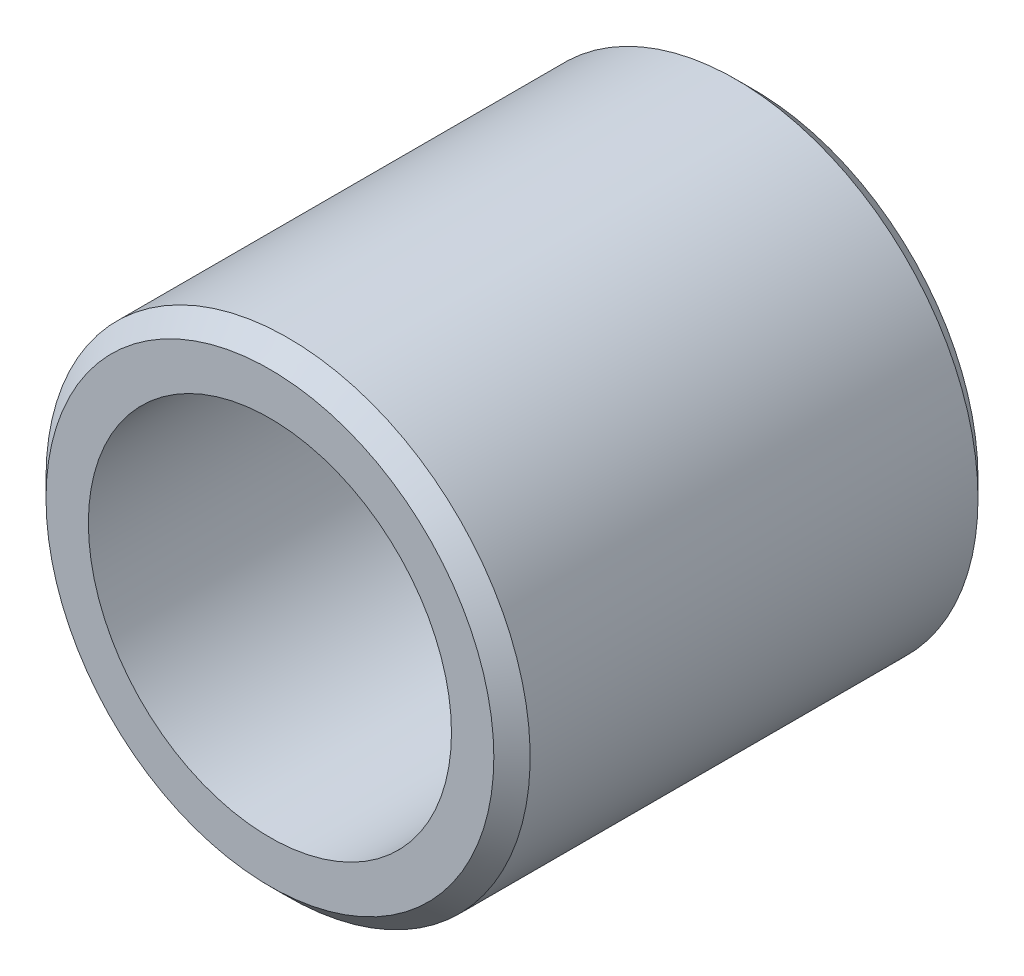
ISO-10303-21;
HEADER;
FILE_DESCRIPTION(('STEP AP214'),'2;1');
FILE_NAME('part.step','',(''),(''),'','','');
FILE_SCHEMA(('AUTOMOTIVE_DESIGN { 1 0 10303 214 1 1 1 1 }'));
ENDSEC;
DATA;
#1=APPLICATION_CONTEXT('core data for automotive mechanical design processes');
#2=APPLICATION_PROTOCOL_DEFINITION('international standard','automotive_design',2000,#1);
#3=PRODUCT_CONTEXT('',#1,'mechanical');
#4=PRODUCT('Part','Part','',(#3));
#5=PRODUCT_RELATED_PRODUCT_CATEGORY('part','',(#4));
#6=PRODUCT_DEFINITION_FORMATION('','',#4);
#7=PRODUCT_DEFINITION_CONTEXT('part definition',#1,'design');
#8=PRODUCT_DEFINITION('design','',#6,#7);
#9=PRODUCT_DEFINITION_SHAPE('','',#8);
#10=(LENGTH_UNIT() NAMED_UNIT(*) SI_UNIT(.MILLI.,.METRE.));
#11=(NAMED_UNIT(*) PLANE_ANGLE_UNIT() SI_UNIT($,.RADIAN.));
#12=(NAMED_UNIT(*) SI_UNIT($,.STERADIAN.) SOLID_ANGLE_UNIT());
#13=UNCERTAINTY_MEASURE_WITH_UNIT(LENGTH_MEASURE(1.E-05),#10,'distance_accuracy_value','');
#14=(GEOMETRIC_REPRESENTATION_CONTEXT(3) GLOBAL_UNCERTAINTY_ASSIGNED_CONTEXT((#13)) GLOBAL_UNIT_ASSIGNED_CONTEXT((#10,
#11,#12)) REPRESENTATION_CONTEXT('',''));
#15=CARTESIAN_POINT('',(0.,0.,0.));
#16=DIRECTION('',(0.,0.,1.));
#17=DIRECTION('',(1.,0.,0.));
#18=AXIS2_PLACEMENT_3D('',#15,#16,#17);
#19=CARTESIAN_POINT('',(0.,0.,8.));
#20=DIRECTION('',(0.,0.,-1.));
#21=DIRECTION('',(-1.,0.,0.));
#22=AXIS2_PLACEMENT_3D('',#19,#20,#21);
#23=CYLINDRICAL_SURFACE('',#22,4.);
#24=CARTESIAN_POINT('',(0.,0.,0.299999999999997));
#25=DIRECTION('',(0.,0.,1.));
#26=DIRECTION('',(1.,0.,0.));
#27=AXIS2_PLACEMENT_3D('',#24,#25,#26);
#28=CIRCLE('',#27,4.);
#29=CARTESIAN_POINT('',(4.,0.,0.299999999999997));
#30=VERTEX_POINT('',#29);
#31=EDGE_CURVE('E36',#30,#30,#28,.T.);
#32=ORIENTED_EDGE('',*,*,#31,.T.);
#33=EDGE_LOOP('',(#32));
#34=FACE_BOUND('',#33,.T.);
#35=CARTESIAN_POINT('',(0.,0.,7.7));
#36=DIRECTION('',(0.,0.,1.));
#37=DIRECTION('',(1.,0.,0.));
#38=AXIS2_PLACEMENT_3D('',#35,#36,#37);
#39=CIRCLE('',#38,4.);
#40=CARTESIAN_POINT('',(-4.,0.,7.7));
#41=VERTEX_POINT('',#40);
#42=EDGE_CURVE('E41',#41,#41,#39,.F.);
#43=ORIENTED_EDGE('',*,*,#42,.T.);
#44=EDGE_LOOP('',(#43));
#45=FACE_BOUND('',#44,.T.);
#46=ADVANCED_FACE('F25',(#34,#45),#23,.T.);
#47=CARTESIAN_POINT('',(0.,0.,8.));
#48=DIRECTION('',(0.,0.,1.));
#49=DIRECTION('',(1.,0.,0.));
#50=AXIS2_PLACEMENT_3D('',#47,#48,#49);
#51=PLANE('',#50);
#52=CARTESIAN_POINT('',(0.,0.,8.));
#53=DIRECTION('',(0.,0.,1.));
#54=DIRECTION('',(1.,0.,0.));
#55=AXIS2_PLACEMENT_3D('',#52,#53,#54);
#56=CIRCLE('',#55,3.);
#57=CARTESIAN_POINT('',(3.,0.,8.));
#58=VERTEX_POINT('',#57);
#59=EDGE_CURVE('E47',#58,#58,#56,.T.);
#60=ORIENTED_EDGE('',*,*,#59,.F.);
#61=EDGE_LOOP('',(#60));
#62=FACE_BOUND('',#61,.T.);
#63=CARTESIAN_POINT('',(0.,0.,8.));
#64=DIRECTION('',(0.,0.,1.));
#65=DIRECTION('',(1.,0.,0.));
#66=AXIS2_PLACEMENT_3D('',#63,#64,#65);
#67=CIRCLE('',#66,3.7);
#68=CARTESIAN_POINT('',(-3.7,0.,8.));
#69=VERTEX_POINT('',#68);
#70=EDGE_CURVE('E10',#69,#69,#67,.T.);
#71=ORIENTED_EDGE('',*,*,#70,.T.);
#72=EDGE_LOOP('',(#71));
#73=FACE_BOUND('',#72,.T.);
#74=ADVANCED_FACE('F72',(#62,#73),#51,.T.);
#75=CARTESIAN_POINT('',(0.,0.,0.));
#76=DIRECTION('',(0.,0.,1.));
#77=DIRECTION('',(1.,0.,0.));
#78=AXIS2_PLACEMENT_3D('',#75,#76,#77);
#79=PLANE('',#78);
#80=CARTESIAN_POINT('',(0.,0.,0.));
#81=DIRECTION('',(0.,0.,-1.));
#82=DIRECTION('',(-1.,0.,0.));
#83=AXIS2_PLACEMENT_3D('',#80,#81,#82);
#84=CIRCLE('',#83,2.5);
#85=CARTESIAN_POINT('',(-2.5,0.,0.));
#86=VERTEX_POINT('',#85);
#87=EDGE_CURVE('E50',#86,#86,#84,.T.);
#88=ORIENTED_EDGE('',*,*,#87,.F.);
#89=EDGE_LOOP('',(#88));
#90=FACE_BOUND('',#89,.T.);
#91=CARTESIAN_POINT('',(0.,0.,0.));
#92=DIRECTION('',(0.,0.,1.));
#93=DIRECTION('',(1.,0.,0.));
#94=AXIS2_PLACEMENT_3D('',#91,#92,#93);
#95=CIRCLE('',#94,3.7);
#96=CARTESIAN_POINT('',(3.7,0.,0.));
#97=VERTEX_POINT('',#96);
#98=EDGE_CURVE('E32',#97,#97,#95,.F.);
#99=ORIENTED_EDGE('',*,*,#98,.T.);
#100=EDGE_LOOP('',(#99));
#101=FACE_BOUND('',#100,.T.);
#102=ADVANCED_FACE('F74',(#90,#101),#79,.F.);
#103=CARTESIAN_POINT('',(0.,0.,0.299999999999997));
#104=DIRECTION('',(0.,0.,1.));
#105=DIRECTION('',(1.,0.,0.));
#106=AXIS2_PLACEMENT_3D('',#103,#104,#105);
#107=CONICAL_SURFACE('',#106,4.,0.785398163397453);
#108=ORIENTED_EDGE('',*,*,#98,.F.);
#109=EDGE_LOOP('',(#108));
#110=FACE_BOUND('',#109,.T.);
#111=ORIENTED_EDGE('',*,*,#31,.F.);
#112=EDGE_LOOP('',(#111));
#113=FACE_BOUND('',#112,.T.);
#114=ADVANCED_FACE('F79',(#110,#113),#107,.T.);
#115=CARTESIAN_POINT('',(0.,0.,8.));
#116=DIRECTION('',(0.,0.,-1.));
#117=DIRECTION('',(-1.,0.,0.));
#118=AXIS2_PLACEMENT_3D('',#115,#116,#117);
#119=CONICAL_SURFACE('',#118,3.7,0.78539816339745);
#120=CARTESIAN_POINT('',(-4.,0.,7.7));
#121=CARTESIAN_POINT('',(-3.996875,0.,7.703125));
#122=CARTESIAN_POINT('',(-3.99375,0.,7.70625));
#123=CARTESIAN_POINT('',(-3.9875,0.,7.7125));
#124=CARTESIAN_POINT('',(-3.984375,0.,7.715625));
#125=CARTESIAN_POINT('',(-3.978125,0.,7.721875));
#126=CARTESIAN_POINT('',(-3.975,0.,7.725));
#127=CARTESIAN_POINT('',(-3.96875,0.,7.73125));
#128=CARTESIAN_POINT('',(-3.965625,0.,7.734375));
#129=CARTESIAN_POINT('',(-3.959375,0.,7.740625));
#130=CARTESIAN_POINT('',(-3.95625,0.,7.74375));
#131=CARTESIAN_POINT('',(-3.95,0.,7.75));
#132=CARTESIAN_POINT('',(-3.946875,0.,7.753125));
#133=CARTESIAN_POINT('',(-3.940625,0.,7.759375));
#134=CARTESIAN_POINT('',(-3.9375,0.,7.7625));
#135=CARTESIAN_POINT('',(-3.93125,0.,7.76875));
#136=CARTESIAN_POINT('',(-3.928125,0.,7.771875));
#137=CARTESIAN_POINT('',(-3.921875,0.,7.778125));
#138=CARTESIAN_POINT('',(-3.91875,0.,7.78125));
#139=CARTESIAN_POINT('',(-3.9125,0.,7.7875));
#140=CARTESIAN_POINT('',(-3.909375,0.,7.790625));
#141=CARTESIAN_POINT('',(-3.903125,0.,7.796875));
#142=CARTESIAN_POINT('',(-3.9,0.,7.8));
#143=CARTESIAN_POINT('',(-3.89375,0.,7.80625));
#144=CARTESIAN_POINT('',(-3.890625,0.,7.809375));
#145=CARTESIAN_POINT('',(-3.884375,0.,7.815625));
#146=CARTESIAN_POINT('',(-3.88125,0.,7.81875));
#147=CARTESIAN_POINT('',(-3.875,0.,7.825));
#148=CARTESIAN_POINT('',(-3.871875,0.,7.828125));
#149=CARTESIAN_POINT('',(-3.865625,0.,7.834375));
#150=CARTESIAN_POINT('',(-3.8625,0.,7.8375));
#151=CARTESIAN_POINT('',(-3.85625,0.,7.84375));
#152=CARTESIAN_POINT('',(-3.853125,0.,7.846875));
#153=CARTESIAN_POINT('',(-3.846875,0.,7.853125));
#154=CARTESIAN_POINT('',(-3.84375,0.,7.85625));
#155=CARTESIAN_POINT('',(-3.8375,0.,7.8625));
#156=CARTESIAN_POINT('',(-3.834375,0.,7.865625));
#157=CARTESIAN_POINT('',(-3.828125,0.,7.871875));
#158=CARTESIAN_POINT('',(-3.825,0.,7.875));
#159=CARTESIAN_POINT('',(-3.81875,0.,7.88125));
#160=CARTESIAN_POINT('',(-3.815625,0.,7.884375));
#161=CARTESIAN_POINT('',(-3.809375,0.,7.890625));
#162=CARTESIAN_POINT('',(-3.80625,0.,7.89375));
#163=CARTESIAN_POINT('',(-3.8,0.,7.9));
#164=CARTESIAN_POINT('',(-3.796875,0.,7.903125));
#165=CARTESIAN_POINT('',(-3.790625,0.,7.909375));
#166=CARTESIAN_POINT('',(-3.7875,0.,7.9125));
#167=CARTESIAN_POINT('',(-3.78125,0.,7.91875));
#168=CARTESIAN_POINT('',(-3.778125,0.,7.921875));
#169=CARTESIAN_POINT('',(-3.771875,0.,7.928125));
#170=CARTESIAN_POINT('',(-3.76875,0.,7.93125));
#171=CARTESIAN_POINT('',(-3.7625,0.,7.9375));
#172=CARTESIAN_POINT('',(-3.759375,0.,7.940625));
#173=CARTESIAN_POINT('',(-3.753125,0.,7.946875));
#174=CARTESIAN_POINT('',(-3.75,0.,7.95));
#175=CARTESIAN_POINT('',(-3.74375,0.,7.95625));
#176=CARTESIAN_POINT('',(-3.740625,0.,7.959375));
#177=CARTESIAN_POINT('',(-3.734375,0.,7.965625));
#178=CARTESIAN_POINT('',(-3.73125,0.,7.96875));
#179=CARTESIAN_POINT('',(-3.725,0.,7.975));
#180=CARTESIAN_POINT('',(-3.721875,0.,7.978125));
#181=CARTESIAN_POINT('',(-3.715625,0.,7.984375));
#182=CARTESIAN_POINT('',(-3.7125,0.,7.9875));
#183=CARTESIAN_POINT('',(-3.70625,0.,7.99375));
#184=CARTESIAN_POINT('',(-3.703125,0.,7.996875));
#185=CARTESIAN_POINT('',(-3.7,0.,8.));
#186=B_SPLINE_CURVE_WITH_KNOTS('',3,(#120,#121,#122,#123,#124,#125,#126,#127,#128,#129,#130,
#131,#132,#133,#134,#135,#136,#137,#138,#139,#140,#141,#142,#143,#144,#145,#146,#147,#148,#149,
#150,#151,#152,#153,#154,#155,#156,#157,#158,#159,#160,#161,#162,#163,#164,#165,#166,#167,#168,
#169,#170,#171,#172,#173,#174,#175,#176,#177,#178,#179,#180,#181,#182,#183,#184,#185),
.UNSPECIFIED.,.F.,.F.,(4,2,2,2,2,2,2,2,2,2,2,2,2,2,2,2,2,2,2,2,2,2,2,2,2,2,2,2,2,2,2,2,4),(0.,
0.0132582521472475,0.0265165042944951,0.0397747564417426,0.0530330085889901,0.0662912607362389,
0.0795495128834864,0.092807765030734,0.106066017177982,0.11932426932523,0.132582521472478,
0.145840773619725,0.159099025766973,0.172357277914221,0.185615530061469,0.198873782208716,
0.212132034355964,0.225390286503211,0.23864853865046,0.251906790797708,0.265165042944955,
0.278423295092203,0.29168154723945,0.304939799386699,0.318198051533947,0.331456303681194,
0.344714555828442,0.357972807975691,0.371231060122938,0.384489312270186,0.397747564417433,
0.411005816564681,0.42426406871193),.UNSPECIFIED.);
#187=EDGE_CURVE('BSEAM68',#41,#69,#186,.T.);
#188=ORIENTED_EDGE('',*,*,#42,.F.);
#189=ORIENTED_EDGE('',*,*,#70,.F.);
#190=ORIENTED_EDGE('',*,*,#187,.T.);
#191=ORIENTED_EDGE('',*,*,#187,.F.);
#192=EDGE_LOOP('',(#188,#190,#189,#191));
#193=FACE_BOUND('',#192,.T.);
#194=ADVANCED_FACE('F68',(#193),#119,.T.);
#195=CARTESIAN_POINT('',(0.,0.,1.));
#196=DIRECTION('',(0.,0.,1.));
#197=DIRECTION('',(1.,0.,0.));
#198=AXIS2_PLACEMENT_3D('',#195,#196,#197);
#199=CYLINDRICAL_SURFACE('',#198,3.);
#200=CARTESIAN_POINT('',(0.,0.,1.));
#201=DIRECTION('',(0.,0.,1.));
#202=DIRECTION('',(1.,0.,0.));
#203=AXIS2_PLACEMENT_3D('',#200,#201,#202);
#204=CIRCLE('',#203,3.);
#205=CARTESIAN_POINT('',(3.,0.,1.));
#206=VERTEX_POINT('',#205);
#207=EDGE_CURVE('E44',#206,#206,#204,.T.);
#208=ORIENTED_EDGE('',*,*,#207,.F.);
#209=EDGE_LOOP('',(#208));
#210=FACE_BOUND('',#209,.T.);
#211=ORIENTED_EDGE('',*,*,#59,.T.);
#212=EDGE_LOOP('',(#211));
#213=FACE_BOUND('',#212,.T.);
#214=ADVANCED_FACE('F62',(#210,#213),#199,.F.);
#215=CARTESIAN_POINT('',(0.,0.,1.));
#216=DIRECTION('',(0.,0.,1.));
#217=DIRECTION('',(1.,0.,0.));
#218=AXIS2_PLACEMENT_3D('',#215,#216,#217);
#219=PLANE('',#218);
#220=CARTESIAN_POINT('',(0.,0.,1.));
#221=DIRECTION('',(0.,0.,1.));
#222=DIRECTION('',(1.,0.,0.));
#223=AXIS2_PLACEMENT_3D('',#220,#221,#222);
#224=CIRCLE('',#223,2.5);
#225=CARTESIAN_POINT('',(2.5,0.,1.));
#226=VERTEX_POINT('',#225);
#227=EDGE_CURVE('E28',#226,#226,#224,.T.);
#228=ORIENTED_EDGE('',*,*,#227,.F.);
#229=EDGE_LOOP('',(#228));
#230=FACE_BOUND('',#229,.T.);
#231=ORIENTED_EDGE('',*,*,#207,.T.);
#232=EDGE_LOOP('',(#231));
#233=FACE_BOUND('',#232,.T.);
#234=ADVANCED_FACE('F59',(#230,#233),#219,.T.);
#235=CARTESIAN_POINT('',(0.,0.,8.));
#236=DIRECTION('',(0.,0.,-1.));
#237=DIRECTION('',(-1.,0.,0.));
#238=AXIS2_PLACEMENT_3D('',#235,#236,#237);
#239=CYLINDRICAL_SURFACE('',#238,2.5);
#240=ORIENTED_EDGE('',*,*,#227,.T.);
#241=EDGE_LOOP('',(#240));
#242=FACE_BOUND('',#241,.T.);
#243=ORIENTED_EDGE('',*,*,#87,.T.);
#244=EDGE_LOOP('',(#243));
#245=FACE_BOUND('',#244,.T.);
#246=ADVANCED_FACE('F57',(#242,#245),#239,.F.);
#247=CLOSED_SHELL('',(#46,#74,#102,#114,#194,#214,#234,#246));
#248=MANIFOLD_SOLID_BREP('B2',#247);
#249=ADVANCED_BREP_SHAPE_REPRESENTATION('',(#18,#248),#14);
#250=SHAPE_DEFINITION_REPRESENTATION(#9,#249);
ENDSEC;
END-ISO-10303-21;
